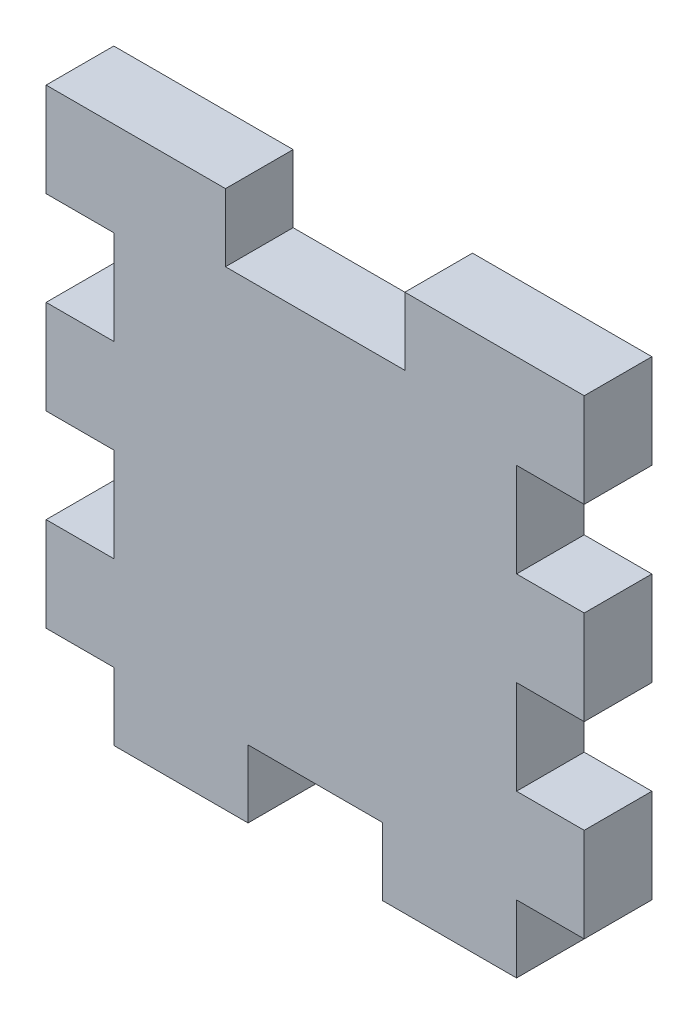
ISO-10303-21;
HEADER;
FILE_DESCRIPTION(('STEP AP214'),'2;1');
FILE_NAME('part.step','',(''),(''),'','','');
FILE_SCHEMA(('AUTOMOTIVE_DESIGN { 1 0 10303 214 1 1 1 1 }'));
ENDSEC;
DATA;
#1=APPLICATION_CONTEXT('core data for automotive mechanical design processes');
#2=APPLICATION_PROTOCOL_DEFINITION('international standard','automotive_design',2000,#1);
#3=PRODUCT_CONTEXT('',#1,'mechanical');
#4=PRODUCT('Part','Part','',(#3));
#5=PRODUCT_RELATED_PRODUCT_CATEGORY('part','',(#4));
#6=PRODUCT_DEFINITION_FORMATION('','',#4);
#7=PRODUCT_DEFINITION_CONTEXT('part definition',#1,'design');
#8=PRODUCT_DEFINITION('design','',#6,#7);
#9=PRODUCT_DEFINITION_SHAPE('','',#8);
#10=(LENGTH_UNIT() NAMED_UNIT(*) SI_UNIT(.MILLI.,.METRE.));
#11=(NAMED_UNIT(*) PLANE_ANGLE_UNIT() SI_UNIT($,.RADIAN.));
#12=(NAMED_UNIT(*) SI_UNIT($,.STERADIAN.) SOLID_ANGLE_UNIT());
#13=UNCERTAINTY_MEASURE_WITH_UNIT(LENGTH_MEASURE(1.E-05),#10,'distance_accuracy_value','');
#14=(GEOMETRIC_REPRESENTATION_CONTEXT(3) GLOBAL_UNCERTAINTY_ASSIGNED_CONTEXT((#13)) GLOBAL_UNIT_ASSIGNED_CONTEXT((#10,
#11,#12)) REPRESENTATION_CONTEXT('',''));
#15=CARTESIAN_POINT('',(0.,0.,0.));
#16=DIRECTION('',(0.,0.,1.));
#17=DIRECTION('',(1.,0.,0.));
#18=AXIS2_PLACEMENT_3D('',#15,#16,#17);
#19=CARTESIAN_POINT('',(0.,-21.209,0.));
#20=DIRECTION('',(0.,1.,0.));
#21=DIRECTION('',(-1.,0.,0.));
#22=AXIS2_PLACEMENT_3D('',#19,#20,#21);
#23=PLANE('',#22);
#24=DIRECTION('',(-1.,0.,0.));
#25=VECTOR('',#24,1.);
#26=CARTESIAN_POINT('',(0.,-21.209,0.));
#27=LINE('',#26,#25);
#28=CARTESIAN_POINT('',(-5.29166666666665,-21.209,0.));
#29=VERTEX_POINT('',#28);
#30=CARTESIAN_POINT('',(-15.875,-21.209,0.));
#31=VERTEX_POINT('',#30);
#32=EDGE_CURVE('E260',#29,#31,#27,.T.);
#33=ORIENTED_EDGE('',*,*,#32,.F.);
#34=DIRECTION('',(0.,0.,1.));
#35=VECTOR('',#34,1.);
#36=CARTESIAN_POINT('',(-5.29166666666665,-21.209,0.));
#37=LINE('',#36,#35);
#38=CARTESIAN_POINT('',(-5.29166666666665,-21.209,5.334));
#39=VERTEX_POINT('',#38);
#40=EDGE_CURVE('E42',#29,#39,#37,.T.);
#41=ORIENTED_EDGE('',*,*,#40,.T.);
#42=DIRECTION('',(-1.,0.,0.));
#43=VECTOR('',#42,1.);
#44=CARTESIAN_POINT('',(0.,-21.209,5.334));
#45=LINE('',#44,#43);
#46=CARTESIAN_POINT('',(-15.875,-21.209,5.334));
#47=VERTEX_POINT('',#46);
#48=EDGE_CURVE('E258',#39,#47,#45,.T.);
#49=ORIENTED_EDGE('',*,*,#48,.T.);
#50=DIRECTION('',(0.,0.,1.));
#51=VECTOR('',#50,1.);
#52=CARTESIAN_POINT('',(-15.875,-21.209,0.));
#53=LINE('',#52,#51);
#54=EDGE_CURVE('E368',#31,#47,#53,.T.);
#55=ORIENTED_EDGE('',*,*,#54,.F.);
#56=EDGE_LOOP('',(#33,#41,#49,#55));
#57=FACE_BOUND('',#56,.T.);
#58=ADVANCED_FACE('F34',(#57),#23,.F.);
#59=CARTESIAN_POINT('',(0.,21.209,0.));
#60=DIRECTION('',(0.,1.,0.));
#61=DIRECTION('',(0.,0.,1.));
#62=AXIS2_PLACEMENT_3D('',#59,#60,#61);
#63=PLANE('',#62);
#64=DIRECTION('',(0.,0.,1.));
#65=VECTOR('',#64,1.);
#66=CARTESIAN_POINT('',(-7.06966666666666,21.209,0.));
#67=LINE('',#66,#65);
#68=CARTESIAN_POINT('',(-7.06966666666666,21.209,0.));
#69=VERTEX_POINT('',#68);
#70=CARTESIAN_POINT('',(-7.06966666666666,21.209,5.334));
#71=VERTEX_POINT('',#70);
#72=EDGE_CURVE('E424',#69,#71,#67,.T.);
#73=ORIENTED_EDGE('',*,*,#72,.F.);
#74=DIRECTION('',(-1.,0.,0.));
#75=VECTOR('',#74,1.);
#76=CARTESIAN_POINT('',(0.,21.209,0.));
#77=LINE('',#76,#75);
#78=CARTESIAN_POINT('',(-21.209,21.209,0.));
#79=VERTEX_POINT('',#78);
#80=EDGE_CURVE('E284',#69,#79,#77,.T.);
#81=ORIENTED_EDGE('',*,*,#80,.T.);
#82=DIRECTION('',(0.,0.,1.));
#83=VECTOR('',#82,1.);
#84=CARTESIAN_POINT('',(-21.209,21.209,0.));
#85=LINE('',#84,#83);
#86=CARTESIAN_POINT('',(-21.209,21.209,5.334));
#87=VERTEX_POINT('',#86);
#88=EDGE_CURVE('E314',#79,#87,#85,.T.);
#89=ORIENTED_EDGE('',*,*,#88,.T.);
#90=DIRECTION('',(-1.,0.,0.));
#91=VECTOR('',#90,1.);
#92=CARTESIAN_POINT('',(0.,21.209,5.334));
#93=LINE('',#92,#91);
#94=EDGE_CURVE('E299',#71,#87,#93,.T.);
#95=ORIENTED_EDGE('',*,*,#94,.F.);
#96=EDGE_LOOP('',(#73,#81,#89,#95));
#97=FACE_BOUND('',#96,.T.);
#98=ADVANCED_FACE('F542',(#97),#63,.T.);
#99=CARTESIAN_POINT('',(21.209,-46.8012213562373,0.));
#100=DIRECTION('',(-1.,0.,0.));
#101=DIRECTION('',(0.,-1.,0.));
#102=AXIS2_PLACEMENT_3D('',#99,#100,#101);
#103=PLANE('',#102);
#104=DIRECTION('',(0.,-1.,0.));
#105=VECTOR('',#104,1.);
#106=CARTESIAN_POINT('',(21.209,-46.8012213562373,5.334));
#107=LINE('',#106,#105);
#108=CARTESIAN_POINT('',(21.209,6.37539999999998,5.334));
#109=VERTEX_POINT('',#108);
#110=CARTESIAN_POINT('',(21.209,-1.04140000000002,5.334));
#111=VERTEX_POINT('',#110);
#112=EDGE_CURVE('E300',#109,#111,#107,.T.);
#113=ORIENTED_EDGE('',*,*,#112,.T.);
#114=DIRECTION('',(0.,0.,-1.));
#115=VECTOR('',#114,1.);
#116=CARTESIAN_POINT('',(21.209,-1.04140000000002,0.));
#117=LINE('',#116,#115);
#118=CARTESIAN_POINT('',(21.209,-1.04140000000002,0.));
#119=VERTEX_POINT('',#118);
#120=EDGE_CURVE('E416',#111,#119,#117,.T.);
#121=ORIENTED_EDGE('',*,*,#120,.T.);
#122=DIRECTION('',(0.,-1.,0.));
#123=VECTOR('',#122,1.);
#124=CARTESIAN_POINT('',(21.209,-46.8012213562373,0.));
#125=LINE('',#124,#123);
#126=CARTESIAN_POINT('',(21.209,6.37539999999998,0.));
#127=VERTEX_POINT('',#126);
#128=EDGE_CURVE('E285',#127,#119,#125,.T.);
#129=ORIENTED_EDGE('',*,*,#128,.F.);
#130=DIRECTION('',(0.,0.,1.));
#131=VECTOR('',#130,1.);
#132=CARTESIAN_POINT('',(21.209,6.37539999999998,0.));
#133=LINE('',#132,#131);
#134=EDGE_CURVE('E406',#127,#109,#133,.T.);
#135=ORIENTED_EDGE('',*,*,#134,.T.);
#136=EDGE_LOOP('',(#113,#121,#129,#135));
#137=FACE_BOUND('',#136,.T.);
#138=ADVANCED_FACE('F573',(#137),#103,.F.);
#139=CARTESIAN_POINT('',(21.209,21.209,5.334));
#140=VERTEX_POINT('',#139);
#141=CARTESIAN_POINT('',(21.209,13.7922,5.334));
#142=VERTEX_POINT('',#141);
#143=EDGE_CURVE('E296',#140,#142,#107,.T.);
#144=ORIENTED_EDGE('',*,*,#143,.T.);
#145=DIRECTION('',(0.,0.,-1.));
#146=VECTOR('',#145,1.);
#147=CARTESIAN_POINT('',(21.209,13.7922,0.));
#148=LINE('',#147,#146);
#149=CARTESIAN_POINT('',(21.209,13.7922,0.));
#150=VERTEX_POINT('',#149);
#151=EDGE_CURVE('E409',#142,#150,#148,.T.);
#152=ORIENTED_EDGE('',*,*,#151,.T.);
#153=CARTESIAN_POINT('',(21.209,21.209,0.));
#154=VERTEX_POINT('',#153);
#155=EDGE_CURVE('E281',#154,#150,#125,.T.);
#156=ORIENTED_EDGE('',*,*,#155,.F.);
#157=DIRECTION('',(0.,0.,1.));
#158=VECTOR('',#157,1.);
#159=CARTESIAN_POINT('',(21.209,21.209,0.));
#160=LINE('',#159,#158);
#161=EDGE_CURVE('E317',#154,#140,#160,.T.);
#162=ORIENTED_EDGE('',*,*,#161,.T.);
#163=EDGE_LOOP('',(#144,#152,#156,#162));
#164=FACE_BOUND('',#163,.T.);
#165=ADVANCED_FACE('F558',(#164),#103,.F.);
#166=CARTESIAN_POINT('',(-21.209,-46.8012213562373,0.));
#167=DIRECTION('',(1.,0.,0.));
#168=DIRECTION('',(0.,0.,-1.));
#169=AXIS2_PLACEMENT_3D('',#166,#167,#168);
#170=PLANE('',#169);
#171=DIRECTION('',(0.,1.,0.));
#172=VECTOR('',#171,1.);
#173=CARTESIAN_POINT('',(-21.209,-46.8012213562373,0.));
#174=LINE('',#173,#172);
#175=CARTESIAN_POINT('',(-21.209,13.7922,0.));
#176=VERTEX_POINT('',#175);
#177=EDGE_CURVE('E290',#176,#79,#174,.T.);
#178=ORIENTED_EDGE('',*,*,#177,.F.);
#179=DIRECTION('',(0.,0.,1.));
#180=VECTOR('',#179,1.);
#181=CARTESIAN_POINT('',(-21.209,13.7922,-4.99999999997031E-05));
#182=LINE('',#181,#180);
#183=CARTESIAN_POINT('',(-21.209,13.7922,5.334));
#184=VERTEX_POINT('',#183);
#185=EDGE_CURVE('E500',#176,#184,#182,.T.);
#186=ORIENTED_EDGE('',*,*,#185,.T.);
#187=DIRECTION('',(0.,1.,0.));
#188=VECTOR('',#187,1.);
#189=CARTESIAN_POINT('',(-21.209,-46.8012213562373,5.334));
#190=LINE('',#189,#188);
#191=EDGE_CURVE('E305',#184,#87,#190,.T.);
#192=ORIENTED_EDGE('',*,*,#191,.T.);
#193=ORIENTED_EDGE('',*,*,#88,.F.);
#194=EDGE_LOOP('',(#178,#186,#192,#193));
#195=FACE_BOUND('',#194,.T.);
#196=ADVANCED_FACE('F537',(#195),#170,.F.);
#197=CARTESIAN_POINT('',(-21.209,-1.0414,5.334));
#198=VERTEX_POINT('',#197);
#199=CARTESIAN_POINT('',(-21.209,6.3754,5.334));
#200=VERTEX_POINT('',#199);
#201=EDGE_CURVE('E309',#198,#200,#190,.T.);
#202=ORIENTED_EDGE('',*,*,#201,.T.);
#203=DIRECTION('',(0.,0.,1.));
#204=VECTOR('',#203,1.);
#205=CARTESIAN_POINT('',(-21.209,6.3754,-4.99999999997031E-05));
#206=LINE('',#205,#204);
#207=CARTESIAN_POINT('',(-21.209,6.3754,0.));
#208=VERTEX_POINT('',#207);
#209=EDGE_CURVE('E499',#208,#200,#206,.T.);
#210=ORIENTED_EDGE('',*,*,#209,.F.);
#211=CARTESIAN_POINT('',(-21.209,-1.0414,0.));
#212=VERTEX_POINT('',#211);
#213=EDGE_CURVE('E295',#212,#208,#174,.T.);
#214=ORIENTED_EDGE('',*,*,#213,.F.);
#215=DIRECTION('',(0.,0.,1.));
#216=VECTOR('',#215,1.);
#217=CARTESIAN_POINT('',(-21.209,-1.0414,0.));
#218=LINE('',#217,#216);
#219=EDGE_CURVE('E391',#212,#198,#218,.T.);
#220=ORIENTED_EDGE('',*,*,#219,.T.);
#221=EDGE_LOOP('',(#202,#210,#214,#220));
#222=FACE_BOUND('',#221,.T.);
#223=ADVANCED_FACE('F529',(#222),#170,.F.);
#224=CARTESIAN_POINT('',(-15.875,-15.875,5.334));
#225=DIRECTION('',(0.,1.,0.));
#226=DIRECTION('',(0.,0.,1.));
#227=AXIS2_PLACEMENT_3D('',#224,#225,#226);
#228=PLANE('',#227);
#229=DIRECTION('',(0.,0.,1.));
#230=VECTOR('',#229,1.);
#231=CARTESIAN_POINT('',(15.875,-15.875,0.));
#232=LINE('',#231,#230);
#233=CARTESIAN_POINT('',(15.875,-15.875,0.));
#234=VERTEX_POINT('',#233);
#235=CARTESIAN_POINT('',(15.875,-15.875,5.334));
#236=VERTEX_POINT('',#235);
#237=EDGE_CURVE('E267',#234,#236,#232,.T.);
#238=ORIENTED_EDGE('',*,*,#237,.F.);
#239=DIRECTION('',(1.,0.,0.));
#240=VECTOR('',#239,1.);
#241=CARTESIAN_POINT('',(-15.875,-15.875,0.));
#242=LINE('',#241,#240);
#243=CARTESIAN_POINT('',(21.209,-15.875,0.));
#244=VERTEX_POINT('',#243);
#245=EDGE_CURVE('E313',#234,#244,#242,.T.);
#246=ORIENTED_EDGE('',*,*,#245,.T.);
#247=DIRECTION('',(0.,0.,1.));
#248=VECTOR('',#247,1.);
#249=CARTESIAN_POINT('',(21.209,-15.875,0.));
#250=LINE('',#249,#248);
#251=CARTESIAN_POINT('',(21.209,-15.875,5.334));
#252=VERTEX_POINT('',#251);
#253=EDGE_CURVE('E294',#244,#252,#250,.T.);
#254=ORIENTED_EDGE('',*,*,#253,.T.);
#255=DIRECTION('',(1.,0.,0.));
#256=VECTOR('',#255,1.);
#257=CARTESIAN_POINT('',(-15.875,-15.875,5.334));
#258=LINE('',#257,#256);
#259=EDGE_CURVE('E327',#236,#252,#258,.T.);
#260=ORIENTED_EDGE('',*,*,#259,.F.);
#261=EDGE_LOOP('',(#238,#246,#254,#260));
#262=FACE_BOUND('',#261,.T.);
#263=ADVANCED_FACE('F347',(#262),#228,.F.);
#264=CARTESIAN_POINT('',(-21.209,-15.875,0.));
#265=VERTEX_POINT('',#264);
#266=CARTESIAN_POINT('',(-15.875,-15.875,0.));
#267=VERTEX_POINT('',#266);
#268=EDGE_CURVE('E334',#265,#267,#242,.T.);
#269=ORIENTED_EDGE('',*,*,#268,.T.);
#270=DIRECTION('',(0.,0.,1.));
#271=VECTOR('',#270,1.);
#272=CARTESIAN_POINT('',(-15.875,-15.875,0.));
#273=LINE('',#272,#271);
#274=CARTESIAN_POINT('',(-15.875,-15.875,5.334));
#275=VERTEX_POINT('',#274);
#276=EDGE_CURVE('E358',#267,#275,#273,.T.);
#277=ORIENTED_EDGE('',*,*,#276,.T.);
#278=CARTESIAN_POINT('',(-21.209,-15.875,5.334));
#279=VERTEX_POINT('',#278);
#280=EDGE_CURVE('E330',#279,#275,#258,.T.);
#281=ORIENTED_EDGE('',*,*,#280,.F.);
#282=DIRECTION('',(0.,0.,1.));
#283=VECTOR('',#282,1.);
#284=CARTESIAN_POINT('',(-21.209,-15.875,0.));
#285=LINE('',#284,#283);
#286=EDGE_CURVE('E310',#265,#279,#285,.T.);
#287=ORIENTED_EDGE('',*,*,#286,.F.);
#288=EDGE_LOOP('',(#269,#277,#281,#287));
#289=FACE_BOUND('',#288,.T.);
#290=ADVANCED_FACE('F36',(#289),#228,.F.);
#291=CARTESIAN_POINT('',(15.875,15.875,5.334));
#292=DIRECTION('',(0.,0.,1.));
#293=DIRECTION('',(1.,0.,0.));
#294=AXIS2_PLACEMENT_3D('',#291,#292,#293);
#295=PLANE('',#294);
#296=DIRECTION('',(0.,-1.,0.));
#297=VECTOR('',#296,1.);
#298=CARTESIAN_POINT('',(-5.29166666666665,-15.875,5.334));
#299=LINE('',#298,#297);
#300=CARTESIAN_POINT('',(-5.29166666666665,-15.875,5.334));
#301=VERTEX_POINT('',#300);
#302=EDGE_CURVE('E243',#301,#39,#299,.T.);
#303=ORIENTED_EDGE('',*,*,#302,.F.);
#304=DIRECTION('',(-1.,0.,0.));
#305=VECTOR('',#304,1.);
#306=CARTESIAN_POINT('',(-5.29166666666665,-15.875,5.334));
#307=LINE('',#306,#305);
#308=CARTESIAN_POINT('',(5.29166666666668,-15.875,5.334));
#309=VERTEX_POINT('',#308);
#310=EDGE_CURVE('E905',#309,#301,#307,.T.);
#311=ORIENTED_EDGE('',*,*,#310,.F.);
#312=DIRECTION('',(0.,1.,0.));
#313=VECTOR('',#312,1.);
#314=CARTESIAN_POINT('',(5.29166666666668,-15.875,5.334));
#315=LINE('',#314,#313);
#316=CARTESIAN_POINT('',(5.29166666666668,-21.209,5.334));
#317=VERTEX_POINT('',#316);
#318=EDGE_CURVE('E253',#317,#309,#315,.T.);
#319=ORIENTED_EDGE('',*,*,#318,.F.);
#320=CARTESIAN_POINT('',(15.875,-21.209,5.334));
#321=VERTEX_POINT('',#320);
#322=EDGE_CURVE('E266',#321,#317,#45,.T.);
#323=ORIENTED_EDGE('',*,*,#322,.F.);
#324=DIRECTION('',(0.,-1.,0.));
#325=VECTOR('',#324,1.);
#326=CARTESIAN_POINT('',(15.875,-46.8012213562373,5.334));
#327=LINE('',#326,#325);
#328=EDGE_CURVE('E272',#236,#321,#327,.T.);
#329=ORIENTED_EDGE('',*,*,#328,.F.);
#330=ORIENTED_EDGE('',*,*,#259,.T.);
#331=CARTESIAN_POINT('',(21.209,-8.45820000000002,5.334));
#332=VERTEX_POINT('',#331);
#333=EDGE_CURVE('E301',#332,#252,#107,.T.);
#334=ORIENTED_EDGE('',*,*,#333,.F.);
#335=DIRECTION('',(1.,0.,0.));
#336=VECTOR('',#335,1.);
#337=CARTESIAN_POINT('',(21.209,-8.45820000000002,5.334));
#338=LINE('',#337,#336);
#339=CARTESIAN_POINT('',(15.875,-8.45820000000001,5.334));
#340=VERTEX_POINT('',#339);
#341=EDGE_CURVE('E461',#340,#332,#338,.T.);
#342=ORIENTED_EDGE('',*,*,#341,.F.);
#343=DIRECTION('',(0.,-1.,0.));
#344=VECTOR('',#343,1.);
#345=CARTESIAN_POINT('',(15.875,-8.45820000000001,5.334));
#346=LINE('',#345,#344);
#347=CARTESIAN_POINT('',(15.875,-1.04140000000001,5.334));
#348=VERTEX_POINT('',#347);
#349=EDGE_CURVE('E458',#348,#340,#346,.T.);
#350=ORIENTED_EDGE('',*,*,#349,.F.);
#351=DIRECTION('',(-1.,0.,0.));
#352=VECTOR('',#351,1.);
#353=CARTESIAN_POINT('',(21.209,-1.04140000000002,5.334));
#354=LINE('',#353,#352);
#355=EDGE_CURVE('E455',#111,#348,#354,.T.);
#356=ORIENTED_EDGE('',*,*,#355,.F.);
#357=ORIENTED_EDGE('',*,*,#112,.F.);
#358=DIRECTION('',(1.,0.,0.));
#359=VECTOR('',#358,1.);
#360=CARTESIAN_POINT('',(21.209,6.37539999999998,5.334));
#361=LINE('',#360,#359);
#362=CARTESIAN_POINT('',(15.875,6.37539999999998,5.334));
#363=VERTEX_POINT('',#362);
#364=EDGE_CURVE('E479',#363,#109,#361,.T.);
#365=ORIENTED_EDGE('',*,*,#364,.F.);
#366=DIRECTION('',(0.,-1.,0.));
#367=VECTOR('',#366,1.);
#368=CARTESIAN_POINT('',(15.875,6.37539999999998,5.334));
#369=LINE('',#368,#367);
#370=CARTESIAN_POINT('',(15.875,13.7922,5.334));
#371=VERTEX_POINT('',#370);
#372=EDGE_CURVE('E476',#371,#363,#369,.T.);
#373=ORIENTED_EDGE('',*,*,#372,.F.);
#374=DIRECTION('',(-1.,0.,0.));
#375=VECTOR('',#374,1.);
#376=CARTESIAN_POINT('',(21.209,13.7922,5.334));
#377=LINE('',#376,#375);
#378=EDGE_CURVE('E473',#142,#371,#377,.T.);
#379=ORIENTED_EDGE('',*,*,#378,.F.);
#380=ORIENTED_EDGE('',*,*,#143,.F.);
#381=CARTESIAN_POINT('',(7.06966666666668,21.209,5.334));
#382=VERTEX_POINT('',#381);
#383=EDGE_CURVE('E302',#140,#382,#93,.T.);
#384=ORIENTED_EDGE('',*,*,#383,.T.);
#385=DIRECTION('',(0.,1.,0.));
#386=VECTOR('',#385,1.);
#387=CARTESIAN_POINT('',(7.06966666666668,21.209,5.334));
#388=LINE('',#387,#386);
#389=CARTESIAN_POINT('',(7.06966666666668,15.875,5.334));
#390=VERTEX_POINT('',#389);
#391=EDGE_CURVE('E57',#390,#382,#388,.T.);
#392=ORIENTED_EDGE('',*,*,#391,.F.);
#393=DIRECTION('',(1.,0.,0.));
#394=VECTOR('',#393,1.);
#395=CARTESIAN_POINT('',(-7.06966666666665,15.875,5.334));
#396=LINE('',#395,#394);
#397=CARTESIAN_POINT('',(-7.06966666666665,15.875,5.334));
#398=VERTEX_POINT('',#397);
#399=EDGE_CURVE('E441',#398,#390,#396,.T.);
#400=ORIENTED_EDGE('',*,*,#399,.F.);
#401=DIRECTION('',(0.,-1.,0.));
#402=VECTOR('',#401,1.);
#403=CARTESIAN_POINT('',(-7.06966666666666,21.209,5.334));
#404=LINE('',#403,#402);
#405=EDGE_CURVE('E433',#71,#398,#404,.T.);
#406=ORIENTED_EDGE('',*,*,#405,.F.);
#407=ORIENTED_EDGE('',*,*,#94,.T.);
#408=ORIENTED_EDGE('',*,*,#191,.F.);
#409=DIRECTION('',(-1.,0.,0.));
#410=VECTOR('',#409,1.);
#411=CARTESIAN_POINT('',(-21.209,13.7922,5.334));
#412=LINE('',#411,#410);
#413=CARTESIAN_POINT('',(-15.875,13.7922,5.334));
#414=VERTEX_POINT('',#413);
#415=EDGE_CURVE('E497',#414,#184,#412,.T.);
#416=ORIENTED_EDGE('',*,*,#415,.F.);
#417=DIRECTION('',(0.,1.,0.));
#418=VECTOR('',#417,1.);
#419=CARTESIAN_POINT('',(-15.875,6.3754,5.334));
#420=LINE('',#419,#418);
#421=CARTESIAN_POINT('',(-15.875,6.3754,5.334));
#422=VERTEX_POINT('',#421);
#423=EDGE_CURVE('E494',#422,#414,#420,.T.);
#424=ORIENTED_EDGE('',*,*,#423,.F.);
#425=DIRECTION('',(1.,0.,0.));
#426=VECTOR('',#425,1.);
#427=CARTESIAN_POINT('',(-21.209,6.3754,5.334));
#428=LINE('',#427,#426);
#429=EDGE_CURVE('E491',#200,#422,#428,.T.);
#430=ORIENTED_EDGE('',*,*,#429,.F.);
#431=ORIENTED_EDGE('',*,*,#201,.F.);
#432=DIRECTION('',(-1.,0.,0.));
#433=VECTOR('',#432,1.);
#434=CARTESIAN_POINT('',(-21.209,-1.0414,5.334));
#435=LINE('',#434,#433);
#436=CARTESIAN_POINT('',(-15.875,-1.0414,5.334));
#437=VERTEX_POINT('',#436);
#438=EDGE_CURVE('E514',#437,#198,#435,.T.);
#439=ORIENTED_EDGE('',*,*,#438,.F.);
#440=DIRECTION('',(0.,1.,0.));
#441=VECTOR('',#440,1.);
#442=CARTESIAN_POINT('',(-15.875,-8.4582,5.334));
#443=LINE('',#442,#441);
#444=CARTESIAN_POINT('',(-15.875,-8.4582,5.334));
#445=VERTEX_POINT('',#444);
#446=EDGE_CURVE('E511',#445,#437,#443,.T.);
#447=ORIENTED_EDGE('',*,*,#446,.F.);
#448=DIRECTION('',(1.,0.,0.));
#449=VECTOR('',#448,1.);
#450=CARTESIAN_POINT('',(-21.209,-8.4582,5.334));
#451=LINE('',#450,#449);
#452=CARTESIAN_POINT('',(-21.209,-8.4582,5.334));
#453=VERTEX_POINT('',#452);
#454=EDGE_CURVE('E503',#453,#445,#451,.T.);
#455=ORIENTED_EDGE('',*,*,#454,.F.);
#456=EDGE_CURVE('E306',#279,#453,#190,.T.);
#457=ORIENTED_EDGE('',*,*,#456,.F.);
#458=ORIENTED_EDGE('',*,*,#280,.T.);
#459=DIRECTION('',(0.,-1.,0.));
#460=VECTOR('',#459,1.);
#461=CARTESIAN_POINT('',(-15.875,-46.8012213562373,5.334));
#462=LINE('',#461,#460);
#463=EDGE_CURVE('E265',#275,#47,#462,.T.);
#464=ORIENTED_EDGE('',*,*,#463,.T.);
#465=ORIENTED_EDGE('',*,*,#48,.F.);
#466=EDGE_LOOP('',(#303,#311,#319,#323,#329,#330,#334,#342,#350,#356,#357,#365,#373,#379,#380,
#384,#392,#400,#406,#407,#408,#416,#424,#430,#431,#439,#447,#455,#457,#458,#464,#465));
#467=FACE_BOUND('',#466,.T.);
#468=ADVANCED_FACE('F263',(#467),#295,.T.);
#469=CARTESIAN_POINT('',(15.875,15.875,0.));
#470=DIRECTION('',(0.,0.,1.));
#471=DIRECTION('',(1.,0.,0.));
#472=AXIS2_PLACEMENT_3D('',#469,#470,#471);
#473=PLANE('',#472);
#474=DIRECTION('',(-1.,0.,0.));
#475=VECTOR('',#474,1.);
#476=CARTESIAN_POINT('',(15.875,-15.875,0.));
#477=LINE('',#476,#475);
#478=CARTESIAN_POINT('',(5.29166666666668,-15.875,0.));
#479=VERTEX_POINT('',#478);
#480=CARTESIAN_POINT('',(-5.29166666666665,-15.875,0.));
#481=VERTEX_POINT('',#480);
#482=EDGE_CURVE('E11',#479,#481,#477,.T.);
#483=ORIENTED_EDGE('',*,*,#482,.T.);
#484=DIRECTION('',(0.,-1.,0.));
#485=VECTOR('',#484,1.);
#486=CARTESIAN_POINT('',(-5.29166666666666,15.875,0.));
#487=LINE('',#486,#485);
#488=EDGE_CURVE('E380',#481,#29,#487,.T.);
#489=ORIENTED_EDGE('',*,*,#488,.T.);
#490=ORIENTED_EDGE('',*,*,#32,.T.);
#491=DIRECTION('',(0.,-1.,0.));
#492=VECTOR('',#491,1.);
#493=CARTESIAN_POINT('',(-15.875,-46.8012213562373,0.));
#494=LINE('',#493,#492);
#495=EDGE_CURVE('E362',#267,#31,#494,.T.);
#496=ORIENTED_EDGE('',*,*,#495,.F.);
#497=ORIENTED_EDGE('',*,*,#268,.F.);
#498=CARTESIAN_POINT('',(-21.209,-8.4582,0.));
#499=VERTEX_POINT('',#498);
#500=EDGE_CURVE('E291',#265,#499,#174,.T.);
#501=ORIENTED_EDGE('',*,*,#500,.T.);
#502=DIRECTION('',(1.,0.,0.));
#503=VECTOR('',#502,1.);
#504=CARTESIAN_POINT('',(15.875,-8.4582,0.));
#505=LINE('',#504,#503);
#506=CARTESIAN_POINT('',(-15.875,-8.4582,0.));
#507=VERTEX_POINT('',#506);
#508=EDGE_CURVE('E519',#499,#507,#505,.T.);
#509=ORIENTED_EDGE('',*,*,#508,.T.);
#510=DIRECTION('',(0.,1.,0.));
#511=VECTOR('',#510,1.);
#512=CARTESIAN_POINT('',(-15.875,15.875,0.));
#513=LINE('',#512,#511);
#514=CARTESIAN_POINT('',(-15.875,-1.0414,0.));
#515=VERTEX_POINT('',#514);
#516=EDGE_CURVE('E394',#507,#515,#513,.T.);
#517=ORIENTED_EDGE('',*,*,#516,.T.);
#518=DIRECTION('',(-1.,0.,0.));
#519=VECTOR('',#518,1.);
#520=CARTESIAN_POINT('',(15.875,-1.0414,0.));
#521=LINE('',#520,#519);
#522=EDGE_CURVE('E361',#515,#212,#521,.T.);
#523=ORIENTED_EDGE('',*,*,#522,.T.);
#524=ORIENTED_EDGE('',*,*,#213,.T.);
#525=DIRECTION('',(1.,0.,0.));
#526=VECTOR('',#525,1.);
#527=CARTESIAN_POINT('',(15.875,6.3754,0.));
#528=LINE('',#527,#526);
#529=CARTESIAN_POINT('',(-15.875,6.3754,0.));
#530=VERTEX_POINT('',#529);
#531=EDGE_CURVE('E397',#208,#530,#528,.T.);
#532=ORIENTED_EDGE('',*,*,#531,.T.);
#533=DIRECTION('',(0.,1.,0.));
#534=VECTOR('',#533,1.);
#535=CARTESIAN_POINT('',(-15.875,15.875,0.));
#536=LINE('',#535,#534);
#537=CARTESIAN_POINT('',(-15.875,13.7922,0.));
#538=VERTEX_POINT('',#537);
#539=EDGE_CURVE('E400',#530,#538,#536,.T.);
#540=ORIENTED_EDGE('',*,*,#539,.T.);
#541=DIRECTION('',(-1.,0.,0.));
#542=VECTOR('',#541,1.);
#543=CARTESIAN_POINT('',(15.875,13.7922,0.));
#544=LINE('',#543,#542);
#545=EDGE_CURVE('E403',#538,#176,#544,.T.);
#546=ORIENTED_EDGE('',*,*,#545,.T.);
#547=ORIENTED_EDGE('',*,*,#177,.T.);
#548=ORIENTED_EDGE('',*,*,#80,.F.);
#549=DIRECTION('',(0.,-1.,0.));
#550=VECTOR('',#549,1.);
#551=CARTESIAN_POINT('',(-7.06966666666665,15.875,0.));
#552=LINE('',#551,#550);
#553=CARTESIAN_POINT('',(-7.06966666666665,15.875,0.));
#554=VERTEX_POINT('',#553);
#555=EDGE_CURVE('E452',#69,#554,#552,.T.);
#556=ORIENTED_EDGE('',*,*,#555,.T.);
#557=DIRECTION('',(1.,0.,0.));
#558=VECTOR('',#557,1.);
#559=CARTESIAN_POINT('',(15.875,15.875,0.));
#560=LINE('',#559,#558);
#561=CARTESIAN_POINT('',(7.06966666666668,15.875,0.));
#562=VERTEX_POINT('',#561);
#563=EDGE_CURVE('E426',#554,#562,#560,.T.);
#564=ORIENTED_EDGE('',*,*,#563,.T.);
#565=DIRECTION('',(0.,1.,0.));
#566=VECTOR('',#565,1.);
#567=CARTESIAN_POINT('',(7.06966666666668,15.875,0.));
#568=LINE('',#567,#566);
#569=CARTESIAN_POINT('',(7.06966666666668,21.209,0.));
#570=VERTEX_POINT('',#569);
#571=EDGE_CURVE('E448',#562,#570,#568,.T.);
#572=ORIENTED_EDGE('',*,*,#571,.T.);
#573=EDGE_CURVE('E287',#154,#570,#77,.T.);
#574=ORIENTED_EDGE('',*,*,#573,.F.);
#575=ORIENTED_EDGE('',*,*,#155,.T.);
#576=DIRECTION('',(-1.,0.,0.));
#577=VECTOR('',#576,1.);
#578=CARTESIAN_POINT('',(15.875,13.7922,0.));
#579=LINE('',#578,#577);
#580=CARTESIAN_POINT('',(15.875,13.7922,0.));
#581=VERTEX_POINT('',#580);
#582=EDGE_CURVE('E488',#150,#581,#579,.T.);
#583=ORIENTED_EDGE('',*,*,#582,.T.);
#584=DIRECTION('',(0.,-1.,0.));
#585=VECTOR('',#584,1.);
#586=CARTESIAN_POINT('',(15.875,15.875,0.));
#587=LINE('',#586,#585);
#588=CARTESIAN_POINT('',(15.875,6.37539999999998,0.));
#589=VERTEX_POINT('',#588);
#590=EDGE_CURVE('E412',#581,#589,#587,.T.);
#591=ORIENTED_EDGE('',*,*,#590,.T.);
#592=DIRECTION('',(1.,0.,0.));
#593=VECTOR('',#592,1.);
#594=CARTESIAN_POINT('',(15.875,6.37539999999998,0.));
#595=LINE('',#594,#593);
#596=EDGE_CURVE('E484',#589,#127,#595,.T.);
#597=ORIENTED_EDGE('',*,*,#596,.T.);
#598=ORIENTED_EDGE('',*,*,#128,.T.);
#599=DIRECTION('',(-1.,0.,0.));
#600=VECTOR('',#599,1.);
#601=CARTESIAN_POINT('',(15.875,-1.04140000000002,0.));
#602=LINE('',#601,#600);
#603=CARTESIAN_POINT('',(15.875,-1.04140000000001,0.));
#604=VERTEX_POINT('',#603);
#605=EDGE_CURVE('E470',#119,#604,#602,.T.);
#606=ORIENTED_EDGE('',*,*,#605,.T.);
#607=DIRECTION('',(0.,-1.,0.));
#608=VECTOR('',#607,1.);
#609=CARTESIAN_POINT('',(15.875,15.875,0.));
#610=LINE('',#609,#608);
#611=CARTESIAN_POINT('',(15.875,-8.45820000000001,0.));
#612=VERTEX_POINT('',#611);
#613=EDGE_CURVE('E419',#604,#612,#610,.T.);
#614=ORIENTED_EDGE('',*,*,#613,.T.);
#615=DIRECTION('',(1.,0.,0.));
#616=VECTOR('',#615,1.);
#617=CARTESIAN_POINT('',(15.875,-8.45820000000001,0.));
#618=LINE('',#617,#616);
#619=CARTESIAN_POINT('',(21.209,-8.45820000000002,0.));
#620=VERTEX_POINT('',#619);
#621=EDGE_CURVE('E466',#612,#620,#618,.T.);
#622=ORIENTED_EDGE('',*,*,#621,.T.);
#623=EDGE_CURVE('E286',#620,#244,#125,.T.);
#624=ORIENTED_EDGE('',*,*,#623,.T.);
#625=ORIENTED_EDGE('',*,*,#245,.F.);
#626=DIRECTION('',(0.,-1.,0.));
#627=VECTOR('',#626,1.);
#628=CARTESIAN_POINT('',(15.875,-46.8012213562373,0.));
#629=LINE('',#628,#627);
#630=CARTESIAN_POINT('',(15.875,-21.209,0.));
#631=VERTEX_POINT('',#630);
#632=EDGE_CURVE('E369',#234,#631,#629,.T.);
#633=ORIENTED_EDGE('',*,*,#632,.T.);
#634=CARTESIAN_POINT('',(5.29166666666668,-21.209,0.));
#635=VERTEX_POINT('',#634);
#636=EDGE_CURVE('E278',#631,#635,#27,.T.);
#637=ORIENTED_EDGE('',*,*,#636,.T.);
#638=DIRECTION('',(0.,1.,0.));
#639=VECTOR('',#638,1.);
#640=CARTESIAN_POINT('',(5.29166666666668,15.875,0.));
#641=LINE('',#640,#639);
#642=EDGE_CURVE('E49',#635,#479,#641,.T.);
#643=ORIENTED_EDGE('',*,*,#642,.T.);
#644=EDGE_LOOP('',(#483,#489,#490,#496,#497,#501,#509,#517,#523,#524,#532,#540,#546,#547,#548,
#556,#564,#572,#574,#575,#583,#591,#597,#598,#606,#614,#622,#624,#625,#633,#637,#643));
#645=FACE_BOUND('',#644,.T.);
#646=ADVANCED_FACE('F379',(#645),#473,.F.);
#647=ORIENTED_EDGE('',*,*,#456,.T.);
#648=DIRECTION('',(0.,0.,-1.));
#649=VECTOR('',#648,1.);
#650=CARTESIAN_POINT('',(-21.209,-8.4582,0.));
#651=LINE('',#650,#649);
#652=EDGE_CURVE('E332',#453,#499,#651,.T.);
#653=ORIENTED_EDGE('',*,*,#652,.T.);
#654=ORIENTED_EDGE('',*,*,#500,.F.);
#655=ORIENTED_EDGE('',*,*,#286,.T.);
#656=EDGE_LOOP('',(#647,#653,#654,#655));
#657=FACE_BOUND('',#656,.T.);
#658=ADVANCED_FACE('F615',(#657),#170,.F.);
#659=DIRECTION('',(0.,0.,-1.));
#660=VECTOR('',#659,1.);
#661=CARTESIAN_POINT('',(7.06966666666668,21.209,0.));
#662=LINE('',#661,#660);
#663=EDGE_CURVE('E422',#382,#570,#662,.T.);
#664=ORIENTED_EDGE('',*,*,#663,.F.);
#665=ORIENTED_EDGE('',*,*,#383,.F.);
#666=ORIENTED_EDGE('',*,*,#161,.F.);
#667=ORIENTED_EDGE('',*,*,#573,.T.);
#668=EDGE_LOOP('',(#664,#665,#666,#667));
#669=FACE_BOUND('',#668,.T.);
#670=ADVANCED_FACE('F553',(#669),#63,.T.);
#671=ORIENTED_EDGE('',*,*,#623,.F.);
#672=DIRECTION('',(0.,0.,1.));
#673=VECTOR('',#672,1.);
#674=CARTESIAN_POINT('',(21.209,-8.45820000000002,0.));
#675=LINE('',#674,#673);
#676=EDGE_CURVE('E353',#620,#332,#675,.T.);
#677=ORIENTED_EDGE('',*,*,#676,.T.);
#678=ORIENTED_EDGE('',*,*,#333,.T.);
#679=ORIENTED_EDGE('',*,*,#253,.F.);
#680=EDGE_LOOP('',(#671,#677,#678,#679));
#681=FACE_BOUND('',#680,.T.);
#682=ADVANCED_FACE('F351',(#681),#103,.F.);
#683=CARTESIAN_POINT('',(15.875,-46.8012213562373,0.));
#684=DIRECTION('',(-1.,0.,0.));
#685=DIRECTION('',(0.,0.,1.));
#686=AXIS2_PLACEMENT_3D('',#683,#684,#685);
#687=PLANE('',#686);
#688=ORIENTED_EDGE('',*,*,#328,.T.);
#689=DIRECTION('',(0.,0.,1.));
#690=VECTOR('',#689,1.);
#691=CARTESIAN_POINT('',(15.875,-21.209,0.));
#692=LINE('',#691,#690);
#693=EDGE_CURVE('E270',#631,#321,#692,.T.);
#694=ORIENTED_EDGE('',*,*,#693,.F.);
#695=ORIENTED_EDGE('',*,*,#632,.F.);
#696=ORIENTED_EDGE('',*,*,#237,.T.);
#697=EDGE_LOOP('',(#688,#694,#695,#696));
#698=FACE_BOUND('',#697,.T.);
#699=ADVANCED_FACE('F603',(#698),#687,.F.);
#700=ORIENTED_EDGE('',*,*,#322,.T.);
#701=DIRECTION('',(0.,0.,-1.));
#702=VECTOR('',#701,1.);
#703=CARTESIAN_POINT('',(5.29166666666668,-21.209,0.));
#704=LINE('',#703,#702);
#705=EDGE_CURVE('E261',#317,#635,#704,.T.);
#706=ORIENTED_EDGE('',*,*,#705,.T.);
#707=ORIENTED_EDGE('',*,*,#636,.F.);
#708=ORIENTED_EDGE('',*,*,#693,.T.);
#709=EDGE_LOOP('',(#700,#706,#707,#708));
#710=FACE_BOUND('',#709,.T.);
#711=ADVANCED_FACE('F429',(#710),#23,.F.);
#712=CARTESIAN_POINT('',(-15.875,-46.8012213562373,0.));
#713=DIRECTION('',(-1.,0.,0.));
#714=DIRECTION('',(0.,0.,1.));
#715=AXIS2_PLACEMENT_3D('',#712,#713,#714);
#716=PLANE('',#715);
#717=ORIENTED_EDGE('',*,*,#463,.F.);
#718=ORIENTED_EDGE('',*,*,#276,.F.);
#719=ORIENTED_EDGE('',*,*,#495,.T.);
#720=ORIENTED_EDGE('',*,*,#54,.T.);
#721=EDGE_LOOP('',(#717,#718,#719,#720));
#722=FACE_BOUND('',#721,.T.);
#723=ADVANCED_FACE('F377',(#722),#716,.T.);
#724=CARTESIAN_POINT('',(-15.875,-8.4582,-4.99999999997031E-05));
#725=DIRECTION('',(1.,0.,0.));
#726=DIRECTION('',(0.,0.,-1.));
#727=AXIS2_PLACEMENT_3D('',#724,#725,#726);
#728=PLANE('',#727);
#729=DIRECTION('',(0.,0.,1.));
#730=VECTOR('',#729,1.);
#731=CARTESIAN_POINT('',(-15.875,-8.4582,-4.99999999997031E-05));
#732=LINE('',#731,#730);
#733=EDGE_CURVE('E516',#507,#445,#732,.T.);
#734=ORIENTED_EDGE('',*,*,#733,.T.);
#735=ORIENTED_EDGE('',*,*,#446,.T.);
#736=DIRECTION('',(0.,0.,1.));
#737=VECTOR('',#736,1.);
#738=CARTESIAN_POINT('',(-15.875,-1.0414,-4.99999999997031E-05));
#739=LINE('',#738,#737);
#740=EDGE_CURVE('E517',#515,#437,#739,.T.);
#741=ORIENTED_EDGE('',*,*,#740,.F.);
#742=ORIENTED_EDGE('',*,*,#516,.F.);
#743=EDGE_LOOP('',(#734,#735,#741,#742));
#744=FACE_BOUND('',#743,.T.);
#745=ADVANCED_FACE('F608',(#744),#728,.F.);
#746=CARTESIAN_POINT('',(-21.209,-1.0414,-4.99999999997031E-05));
#747=DIRECTION('',(0.,1.,0.));
#748=DIRECTION('',(0.,0.,1.));
#749=AXIS2_PLACEMENT_3D('',#746,#747,#748);
#750=PLANE('',#749);
#751=ORIENTED_EDGE('',*,*,#740,.T.);
#752=ORIENTED_EDGE('',*,*,#438,.T.);
#753=ORIENTED_EDGE('',*,*,#219,.F.);
#754=ORIENTED_EDGE('',*,*,#522,.F.);
#755=EDGE_LOOP('',(#751,#752,#753,#754));
#756=FACE_BOUND('',#755,.T.);
#757=ADVANCED_FACE('F652',(#756),#750,.F.);
#758=CARTESIAN_POINT('',(-21.209,-8.4582,-4.99999999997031E-05));
#759=DIRECTION('',(0.,-1.,0.));
#760=DIRECTION('',(0.,0.,-1.));
#761=AXIS2_PLACEMENT_3D('',#758,#759,#760);
#762=PLANE('',#761);
#763=ORIENTED_EDGE('',*,*,#652,.F.);
#764=ORIENTED_EDGE('',*,*,#454,.T.);
#765=ORIENTED_EDGE('',*,*,#733,.F.);
#766=ORIENTED_EDGE('',*,*,#508,.F.);
#767=EDGE_LOOP('',(#763,#764,#765,#766));
#768=FACE_BOUND('',#767,.T.);
#769=ADVANCED_FACE('F663',(#768),#762,.F.);
#770=CARTESIAN_POINT('',(-21.209,13.7922,-4.99999999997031E-05));
#771=DIRECTION('',(0.,1.,0.));
#772=DIRECTION('',(0.,0.,1.));
#773=AXIS2_PLACEMENT_3D('',#770,#771,#772);
#774=PLANE('',#773);
#775=DIRECTION('',(0.,0.,1.));
#776=VECTOR('',#775,1.);
#777=CARTESIAN_POINT('',(-15.875,13.7922,-4.99999999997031E-05));
#778=LINE('',#777,#776);
#779=EDGE_CURVE('E504',#538,#414,#778,.T.);
#780=ORIENTED_EDGE('',*,*,#779,.T.);
#781=ORIENTED_EDGE('',*,*,#415,.T.);
#782=ORIENTED_EDGE('',*,*,#185,.F.);
#783=ORIENTED_EDGE('',*,*,#545,.F.);
#784=EDGE_LOOP('',(#780,#781,#782,#783));
#785=FACE_BOUND('',#784,.T.);
#786=ADVANCED_FACE('F672',(#785),#774,.F.);
#787=CARTESIAN_POINT('',(-15.875,6.3754,-4.99999999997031E-05));
#788=DIRECTION('',(1.,0.,0.));
#789=DIRECTION('',(0.,0.,-1.));
#790=AXIS2_PLACEMENT_3D('',#787,#788,#789);
#791=PLANE('',#790);
#792=DIRECTION('',(0.,0.,1.));
#793=VECTOR('',#792,1.);
#794=CARTESIAN_POINT('',(-15.875,6.3754,-4.99999999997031E-05));
#795=LINE('',#794,#793);
#796=EDGE_CURVE('E506',#530,#422,#795,.T.);
#797=ORIENTED_EDGE('',*,*,#796,.T.);
#798=ORIENTED_EDGE('',*,*,#423,.T.);
#799=ORIENTED_EDGE('',*,*,#779,.F.);
#800=ORIENTED_EDGE('',*,*,#539,.F.);
#801=EDGE_LOOP('',(#797,#798,#799,#800));
#802=FACE_BOUND('',#801,.T.);
#803=ADVANCED_FACE('F682',(#802),#791,.F.);
#804=CARTESIAN_POINT('',(-21.209,6.3754,-4.99999999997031E-05));
#805=DIRECTION('',(0.,-1.,0.));
#806=DIRECTION('',(0.,0.,-1.));
#807=AXIS2_PLACEMENT_3D('',#804,#805,#806);
#808=PLANE('',#807);
#809=ORIENTED_EDGE('',*,*,#209,.T.);
#810=ORIENTED_EDGE('',*,*,#429,.T.);
#811=ORIENTED_EDGE('',*,*,#796,.F.);
#812=ORIENTED_EDGE('',*,*,#531,.F.);
#813=EDGE_LOOP('',(#809,#810,#811,#812));
#814=FACE_BOUND('',#813,.T.);
#815=ADVANCED_FACE('F692',(#814),#808,.F.);
#816=CARTESIAN_POINT('',(15.875,6.37539999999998,-4.99999999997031E-05));
#817=DIRECTION('',(-1.,0.,0.));
#818=DIRECTION('',(0.,-1.,0.));
#819=AXIS2_PLACEMENT_3D('',#816,#817,#818);
#820=PLANE('',#819);
#821=DIRECTION('',(0.,0.,1.));
#822=VECTOR('',#821,1.);
#823=CARTESIAN_POINT('',(15.875,13.7922,-4.99999999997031E-05));
#824=LINE('',#823,#822);
#825=EDGE_CURVE('E481',#581,#371,#824,.T.);
#826=ORIENTED_EDGE('',*,*,#825,.T.);
#827=ORIENTED_EDGE('',*,*,#372,.T.);
#828=DIRECTION('',(0.,0.,1.));
#829=VECTOR('',#828,1.);
#830=CARTESIAN_POINT('',(15.875,6.37539999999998,-4.99999999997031E-05));
#831=LINE('',#830,#829);
#832=EDGE_CURVE('E482',#589,#363,#831,.T.);
#833=ORIENTED_EDGE('',*,*,#832,.F.);
#834=ORIENTED_EDGE('',*,*,#590,.F.);
#835=EDGE_LOOP('',(#826,#827,#833,#834));
#836=FACE_BOUND('',#835,.T.);
#837=ADVANCED_FACE('F565',(#836),#820,.F.);
#838=CARTESIAN_POINT('',(21.209,13.7922,-4.99999999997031E-05));
#839=DIRECTION('',(0.,1.,0.));
#840=DIRECTION('',(-1.,0.,0.));
#841=AXIS2_PLACEMENT_3D('',#838,#839,#840);
#842=PLANE('',#841);
#843=ORIENTED_EDGE('',*,*,#151,.F.);
#844=ORIENTED_EDGE('',*,*,#378,.T.);
#845=ORIENTED_EDGE('',*,*,#825,.F.);
#846=ORIENTED_EDGE('',*,*,#582,.F.);
#847=EDGE_LOOP('',(#843,#844,#845,#846));
#848=FACE_BOUND('',#847,.T.);
#849=ADVANCED_FACE('F561',(#848),#842,.F.);
#850=CARTESIAN_POINT('',(21.209,6.37539999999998,-4.99999999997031E-05));
#851=DIRECTION('',(0.,-1.,0.));
#852=DIRECTION('',(1.,0.,0.));
#853=AXIS2_PLACEMENT_3D('',#850,#851,#852);
#854=PLANE('',#853);
#855=ORIENTED_EDGE('',*,*,#832,.T.);
#856=ORIENTED_EDGE('',*,*,#364,.T.);
#857=ORIENTED_EDGE('',*,*,#134,.F.);
#858=ORIENTED_EDGE('',*,*,#596,.F.);
#859=EDGE_LOOP('',(#855,#856,#857,#858));
#860=FACE_BOUND('',#859,.T.);
#861=ADVANCED_FACE('F569',(#860),#854,.F.);
#862=CARTESIAN_POINT('',(15.875,-8.45820000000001,-4.99999999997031E-05));
#863=DIRECTION('',(-1.,0.,0.));
#864=DIRECTION('',(0.,-1.,0.));
#865=AXIS2_PLACEMENT_3D('',#862,#863,#864);
#866=PLANE('',#865);
#867=DIRECTION('',(0.,0.,1.));
#868=VECTOR('',#867,1.);
#869=CARTESIAN_POINT('',(15.875,-1.04140000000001,-4.99999999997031E-05));
#870=LINE('',#869,#868);
#871=EDGE_CURVE('E463',#604,#348,#870,.T.);
#872=ORIENTED_EDGE('',*,*,#871,.T.);
#873=ORIENTED_EDGE('',*,*,#349,.T.);
#874=DIRECTION('',(0.,0.,1.));
#875=VECTOR('',#874,1.);
#876=CARTESIAN_POINT('',(15.875,-8.45820000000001,-4.99999999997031E-05));
#877=LINE('',#876,#875);
#878=EDGE_CURVE('E464',#612,#340,#877,.T.);
#879=ORIENTED_EDGE('',*,*,#878,.F.);
#880=ORIENTED_EDGE('',*,*,#613,.F.);
#881=EDGE_LOOP('',(#872,#873,#879,#880));
#882=FACE_BOUND('',#881,.T.);
#883=ADVANCED_FACE('F579',(#882),#866,.F.);
#884=CARTESIAN_POINT('',(21.209,-1.04140000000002,-4.99999999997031E-05));
#885=DIRECTION('',(0.,1.,0.));
#886=DIRECTION('',(-1.,0.,0.));
#887=AXIS2_PLACEMENT_3D('',#884,#885,#886);
#888=PLANE('',#887);
#889=ORIENTED_EDGE('',*,*,#120,.F.);
#890=ORIENTED_EDGE('',*,*,#355,.T.);
#891=ORIENTED_EDGE('',*,*,#871,.F.);
#892=ORIENTED_EDGE('',*,*,#605,.F.);
#893=EDGE_LOOP('',(#889,#890,#891,#892));
#894=FACE_BOUND('',#893,.T.);
#895=ADVANCED_FACE('F584',(#894),#888,.F.);
#896=CARTESIAN_POINT('',(21.209,-8.45820000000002,-4.99999999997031E-05));
#897=DIRECTION('',(0.,-1.,0.));
#898=DIRECTION('',(1.,0.,0.));
#899=AXIS2_PLACEMENT_3D('',#896,#897,#898);
#900=PLANE('',#899);
#901=ORIENTED_EDGE('',*,*,#878,.T.);
#902=ORIENTED_EDGE('',*,*,#341,.T.);
#903=ORIENTED_EDGE('',*,*,#676,.F.);
#904=ORIENTED_EDGE('',*,*,#621,.F.);
#905=EDGE_LOOP('',(#901,#902,#903,#904));
#906=FACE_BOUND('',#905,.T.);
#907=ADVANCED_FACE('F577',(#906),#900,.F.);
#908=CARTESIAN_POINT('',(-7.06966666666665,15.875,-4.99999999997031E-05));
#909=DIRECTION('',(0.,-1.,0.));
#910=DIRECTION('',(1.,0.,0.));
#911=AXIS2_PLACEMENT_3D('',#908,#909,#910);
#912=PLANE('',#911);
#913=DIRECTION('',(0.,0.,1.));
#914=VECTOR('',#913,1.);
#915=CARTESIAN_POINT('',(-7.06966666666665,15.875,-4.99999999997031E-05));
#916=LINE('',#915,#914);
#917=EDGE_CURVE('E445',#554,#398,#916,.T.);
#918=ORIENTED_EDGE('',*,*,#917,.T.);
#919=ORIENTED_EDGE('',*,*,#399,.T.);
#920=DIRECTION('',(0.,0.,1.));
#921=VECTOR('',#920,1.);
#922=CARTESIAN_POINT('',(7.06966666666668,15.875,-4.99999999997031E-05));
#923=LINE('',#922,#921);
#924=EDGE_CURVE('E446',#562,#390,#923,.T.);
#925=ORIENTED_EDGE('',*,*,#924,.F.);
#926=ORIENTED_EDGE('',*,*,#563,.F.);
#927=EDGE_LOOP('',(#918,#919,#925,#926));
#928=FACE_BOUND('',#927,.T.);
#929=ADVANCED_FACE('F550',(#928),#912,.F.);
#930=CARTESIAN_POINT('',(-7.06966666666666,21.209,-4.99999999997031E-05));
#931=DIRECTION('',(-1.,0.,0.));
#932=DIRECTION('',(0.,-1.,0.));
#933=AXIS2_PLACEMENT_3D('',#930,#931,#932);
#934=PLANE('',#933);
#935=ORIENTED_EDGE('',*,*,#72,.T.);
#936=ORIENTED_EDGE('',*,*,#405,.T.);
#937=ORIENTED_EDGE('',*,*,#917,.F.);
#938=ORIENTED_EDGE('',*,*,#555,.F.);
#939=EDGE_LOOP('',(#935,#936,#937,#938));
#940=FACE_BOUND('',#939,.T.);
#941=ADVANCED_FACE('F545',(#940),#934,.F.);
#942=CARTESIAN_POINT('',(7.06966666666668,21.209,-4.99999999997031E-05));
#943=DIRECTION('',(1.,0.,0.));
#944=DIRECTION('',(0.,0.,-1.));
#945=AXIS2_PLACEMENT_3D('',#942,#943,#944);
#946=PLANE('',#945);
#947=ORIENTED_EDGE('',*,*,#924,.T.);
#948=ORIENTED_EDGE('',*,*,#391,.T.);
#949=ORIENTED_EDGE('',*,*,#663,.T.);
#950=ORIENTED_EDGE('',*,*,#571,.F.);
#951=EDGE_LOOP('',(#947,#948,#949,#950));
#952=FACE_BOUND('',#951,.T.);
#953=ADVANCED_FACE('F812',(#952),#946,.F.);
#954=CARTESIAN_POINT('',(-5.29166666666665,-15.875,-4.99999999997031E-05));
#955=DIRECTION('',(0.,1.,0.));
#956=DIRECTION('',(0.,0.,1.));
#957=AXIS2_PLACEMENT_3D('',#954,#955,#956);
#958=PLANE('',#957);
#959=DIRECTION('',(0.,0.,1.));
#960=VECTOR('',#959,1.);
#961=CARTESIAN_POINT('',(5.29166666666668,-15.875,-4.99999999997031E-05));
#962=LINE('',#961,#960);
#963=EDGE_CURVE('E435',#479,#309,#962,.T.);
#964=ORIENTED_EDGE('',*,*,#963,.T.);
#965=ORIENTED_EDGE('',*,*,#310,.T.);
#966=DIRECTION('',(0.,0.,1.));
#967=VECTOR('',#966,1.);
#968=CARTESIAN_POINT('',(-5.29166666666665,-15.875,-4.99999999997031E-05));
#969=LINE('',#968,#967);
#970=EDGE_CURVE('E248',#481,#301,#969,.T.);
#971=ORIENTED_EDGE('',*,*,#970,.F.);
#972=ORIENTED_EDGE('',*,*,#482,.F.);
#973=EDGE_LOOP('',(#964,#965,#971,#972));
#974=FACE_BOUND('',#973,.T.);
#975=ADVANCED_FACE('F807',(#974),#958,.F.);
#976=CARTESIAN_POINT('',(-5.29166666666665,-15.875,-4.99999999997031E-05));
#977=DIRECTION('',(-1.,0.,0.));
#978=DIRECTION('',(0.,-1.,0.));
#979=AXIS2_PLACEMENT_3D('',#976,#977,#978);
#980=PLANE('',#979);
#981=ORIENTED_EDGE('',*,*,#970,.T.);
#982=ORIENTED_EDGE('',*,*,#302,.T.);
#983=ORIENTED_EDGE('',*,*,#40,.F.);
#984=ORIENTED_EDGE('',*,*,#488,.F.);
#985=EDGE_LOOP('',(#981,#982,#983,#984));
#986=FACE_BOUND('',#985,.T.);
#987=ADVANCED_FACE('F245',(#986),#980,.F.);
#988=CARTESIAN_POINT('',(5.29166666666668,-15.875,-4.99999999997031E-05));
#989=DIRECTION('',(1.,0.,0.));
#990=DIRECTION('',(0.,0.,-1.));
#991=AXIS2_PLACEMENT_3D('',#988,#989,#990);
#992=PLANE('',#991);
#993=ORIENTED_EDGE('',*,*,#705,.F.);
#994=ORIENTED_EDGE('',*,*,#318,.T.);
#995=ORIENTED_EDGE('',*,*,#963,.F.);
#996=ORIENTED_EDGE('',*,*,#642,.F.);
#997=EDGE_LOOP('',(#993,#994,#995,#996));
#998=FACE_BOUND('',#997,.T.);
#999=ADVANCED_FACE('F824',(#998),#992,.F.);
#1000=CLOSED_SHELL('',(#58,#98,#138,#165,#196,#223,#263,#290,#468,#646,#658,#670,#682,#699,#711,
#723,#745,#757,#769,#786,#803,#815,#837,#849,#861,#883,#895,#907,#929,#941,#953,#975,#987,#999));
#1001=MANIFOLD_SOLID_BREP('B2',#1000);
#1002=ADVANCED_BREP_SHAPE_REPRESENTATION('',(#18,#1001),#14);
#1003=SHAPE_DEFINITION_REPRESENTATION(#9,#1002);
ENDSEC;
END-ISO-10303-21;
